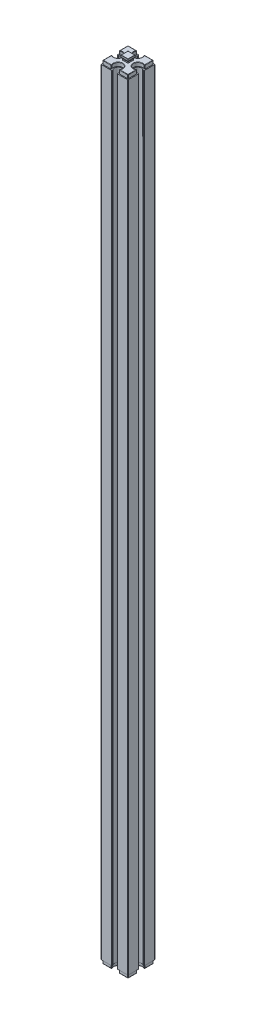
from build123d import *

# Parameters (mm, degrees)
EXTRUDE_1_DEPTH        = 215.5
EXTRUDE_2_DEPTH        = 2
EXTRUDE_3_DEPTH        = 2
FILLET_3_R             = 0.2
CUT_EXTRUDE_1_DEPTH    = 3
FILLET_4_R             = 0.2
FILLET_5_R             = 0.1
FILLET_3_OF_MIRROR_1_R = 0.2
FILLET_4_OF_MIRROR_1_R = 0.2
FILLET_5_OF_MIRROR_1_R = 0.1


with BuildPart() as part:
    # Sketch 1 → Extrude 1 (new body)
    with BuildSketch(Plane(origin=(0, 0, 0), x_dir=(1, 0, 0), z_dir=(0, 1, 0))):
        with BuildLine():
            Line((-7.5, 7.5), (-1.5, 7.5))
            Line((-1.5, 7.5), (-1.5, 6.822875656))
            ThreePointArc((-1.5, 6.822875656), (0, 3.5), (1.5, 6.822875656))
            Line((1.5, 6.822875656), (1.5, 7.5))
            Line((1.5, 7.5), (7.5, 7.5))
            Line((7.5, 7.5), (7.5, 1.5))
            Line((7.5, 1.5), (6.822875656, 1.5))
            ThreePointArc((6.822875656, 1.5), (3.5, 0), (6.822875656, -1.5))
            Line((6.822875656, -1.5), (7.5, -1.5))
            Line((7.5, -1.5), (7.5, -7.5))
            Line((7.5, -7.5), (1.5, -7.5))
            Line((1.5, -7.5), (1.5, -6.822875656))
            ThreePointArc((1.5, -6.822875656), (0, -3.5), (-1.5, -6.822875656))
            Line((-1.5, -6.822875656), (-1.5, -7.5))
            Line((-1.5, -7.5), (-7.5, -7.5))
            Line((-7.5, -7.5), (-7.5, -1.5))
            Line((-7.5, -1.5), (-6.822875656, -1.5))
            ThreePointArc((-6.822875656, -1.5), (-3.5, 0), (-6.822875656, 1.5))
            Line((-6.822875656, 1.5), (-7.5, 1.5))
            Line((-7.5, 1.5), (-7.5, 7.5))
        make_face()
    extrude_1 = extrude(amount=EXTRUDE_1_DEPTH)

    # Sketch 2 → Extrude 2 (add)
    with BuildSketch(Plane(origin=(0, 215.5, 0), x_dir=(1, 0, 0), z_dir=(0, 1, 0))):
        with BuildLine():
            Line((-7, 7), (-7, 2))
            ThreePointArc((-7, 2), (-3, 0), (-7, -2))
            Line((-7, -2), (-7, -7))
            Line((-7, -7), (-2, -7))
            ThreePointArc((-2, -7), (0, -3), (2, -7))
            Line((2, -7), (7, -7))
            Line((7, -7), (7, -2))
            ThreePointArc((7, -2), (3, 0), (7, 2))
            Line((7, 2), (7, 7))
            Line((7, 7), (2, 7))
            ThreePointArc((2, 7), (0, 3), (-2, 7))
            Line((-2, 7), (-7, 7))
        make_face()
    extrude_2 = extrude(amount=EXTRUDE_2_DEPTH)

    # Sketch 3 → Extrude 3 (add, symmetric)
    with BuildSketch(Plane(origin=(0, 0, 0), x_dir=(0, 0, -1), z_dir=(1, 0, 0))):
        with BuildLine():
            Line((-1.5, 217.5), (1.5, 217.5))
            Line((1.5, 217.5), (1.5, 218.177124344))
            ThreePointArc((1.5, 218.177124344), (1.780042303, 218.588161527), (1.95, 219.055590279))
            Line((1.95, 219.055590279), (1.95, 220))
            Line((1.95, 220), (-1.95, 220))
            Line((-1.95, 220), (-1.95, 219.055590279))
            ThreePointArc((-1.95, 219.055590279), (-1.780042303, 218.588161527), (-1.5, 218.177124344))
            Line((-1.5, 218.177124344), (-1.5, 217.5))
        make_face()
    extrude_3 = extrude(amount=EXTRUDE_3_DEPTH, both=True)

    # Fillet 3
    fillet_3_edges = [part.edges().sort_by_distance(p)[0] for p in [
        (-7.5, 107.75, -7.5),
        (-1.5, 107.75, -7.5),
        (1.5, 107.75, -7.5),
        (7.5, 107.75, -7.5),
        (7.5, 107.75, -1.5),
        (7.5, 107.75, 1.5),
        (7.5, 107.75, 7.5),
        (1.5, 107.75, 7.5),
        (-1.5, 107.75, 7.5),
        (-7.5, 107.75, 7.5),
        (-7.5, 107.75, 1.5),
        (-6.822875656, 107.75, -1.5),
        (-7.5, 107.75, -1.5),
    ]]
    fillet(fillet_3_edges, radius=FILLET_3_R)

    # Sketch 4 → Cut-Extrude 1 (cut, symmetric)
    with BuildSketch(Plane.XY):
        with BuildLine():
            Line((1.95, 220), (2, 220))
            Line((2, 220), (2, 217.5))
            Line((2, 217.5), (1.5, 217.5))
            Line((1.5, 217.5), (1.5, 218.177124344))
            ThreePointArc((1.5, 218.177124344), (1.780042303, 218.588161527), (1.95, 219.055590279))
            Line((1.95, 219.055590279), (1.95, 220))
        make_face()
        with BuildLine():
            Line((-1.95, 220), (-1.95, 219.055590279))
            ThreePointArc((-1.95, 219.055590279), (-1.780042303, 218.588161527), (-1.5, 218.177124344))
            Line((-1.5, 218.177124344), (-1.5, 217.5))
            Line((-1.5, 217.5), (-2, 217.5))
            Line((-2, 217.5), (-2, 220))
            Line((-2, 220), (-1.95, 220))
        make_face()
    cut_extrude_1 = extrude(amount=CUT_EXTRUDE_1_DEPTH, both=True, mode=Mode.SUBTRACT)

    # Fillet 4
    fillet_4_edges = [part.edges().sort_by_distance(p)[0] for p in [
        (-2, 216.5, -7),
        (-7, 216.5, -7),
        (-7, 216.5, -2),
        (-7, 216.5, 2),
        (-7, 216.5, 7),
        (-2, 216.5, 7),
        (2, 216.5, 7),
        (7, 216.5, 7),
        (7, 216.5, 2),
        (7, 216.5, -2),
        (7, 216.5, -7),
        (2, 216.5, -7),
        (-4.5, 217.5, -7),
        (-7, 217.5, -4.5),
        (-3, 217.5, 0),
        (-7, 217.5, 4.5),
        (-4.5, 217.5, 7),
        (0, 217.5, 3),
        (4.5, 217.5, 7),
        (7, 217.5, 4.5),
        (3, 217.5, 0),
        (7, 217.5, -4.5),
        (4.5, 217.5, -7),
        (0, 217.5, -3),
    ]]
    fillet(fillet_4_edges, radius=FILLET_4_R)

    # Fillet 5
    fillet_5_edges = [part.edges().sort_by_distance(p)[0] for p in [
        (1.95, 220, 0),
        (0, 220, -1.95),
        (0, 220, 1.95),
        (-1.95, 220, 0),
    ]]
    fillet(fillet_5_edges, radius=FILLET_5_R)

    # Mirror 1: Extrude 1, Extrude 2, Extrude 3, Cut-Extrude 1 across Top Plane
    add(extrude_1.mirror(Plane(origin=(0, 0, 0), x_dir=(1, 0, 0), z_dir=(0, 1, 0))))
    add(extrude_2.mirror(Plane(origin=(0, 0, 0), x_dir=(1, 0, 0), z_dir=(0, 1, 0))))
    add(extrude_3.mirror(Plane(origin=(0, 0, 0), x_dir=(1, 0, 0), z_dir=(0, 1, 0))))
    add(cut_extrude_1.mirror(Plane(origin=(0, 0, 0), x_dir=(1, 0, 0), z_dir=(0, 1, 0))), mode=Mode.SUBTRACT)

    # Fillet 3 of Mirror 1
    fillet_3_of_mirror_1_edges = [part.edges().sort_by_distance(p)[0] for p in [
        (-7.5, -107.75, -7.5),
        (-1.5, -107.75, -7.5),
        (1.5, -107.75, -7.5),
        (7.5, -107.75, -7.5),
        (7.5, -107.75, -1.5),
        (7.5, -107.75, 1.5),
        (7.5, -107.75, 7.5),
        (1.5, -107.75, 7.5),
        (-1.5, -107.75, 7.5),
        (-7.5, -107.75, 7.5),
        (-7.5, -107.75, 1.5),
        (-6.822875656, -107.75, -1.5),
        (-7.5, -107.75, -1.5),
    ]]
    fillet(fillet_3_of_mirror_1_edges, radius=FILLET_3_OF_MIRROR_1_R)

    # Fillet 4 of Mirror 1
    fillet_4_of_mirror_1_edges = [part.edges().sort_by_distance(p)[0] for p in [
        (-2, -216.5, -7),
        (-7, -216.5, -7),
        (-7, -216.5, -2),
        (-7, -216.5, 2),
        (-7, -216.5, 7),
        (-2, -216.5, 7),
        (2, -216.5, 7),
        (7, -216.5, 7),
        (7, -216.5, 2),
        (7, -216.5, -2),
        (7, -216.5, -7),
        (2, -216.5, -7),
        (-4.5, -217.5, -7),
        (-7, -217.5, -4.5),
        (-3, -217.5, 0),
        (-7, -217.5, 4.5),
        (-4.5, -217.5, 7),
        (0, -217.5, 3),
        (4.5, -217.5, 7),
        (7, -217.5, 4.5),
        (3, -217.5, 0),
        (7, -217.5, -4.5),
        (4.5, -217.5, -7),
        (0, -217.5, -3),
    ]]
    fillet(fillet_4_of_mirror_1_edges, radius=FILLET_4_OF_MIRROR_1_R)

    # Fillet 5 of Mirror 1
    fillet_5_of_mirror_1_edges = [part.edges().sort_by_distance(p)[0] for p in [
        (1.95, -220, 0),
        (0, -220, -1.95),
        (0, -220, 1.95),
        (-1.95, -220, 0),
    ]]
    fillet(fillet_5_of_mirror_1_edges, radius=FILLET_5_OF_MIRROR_1_R)


solid = part.part
